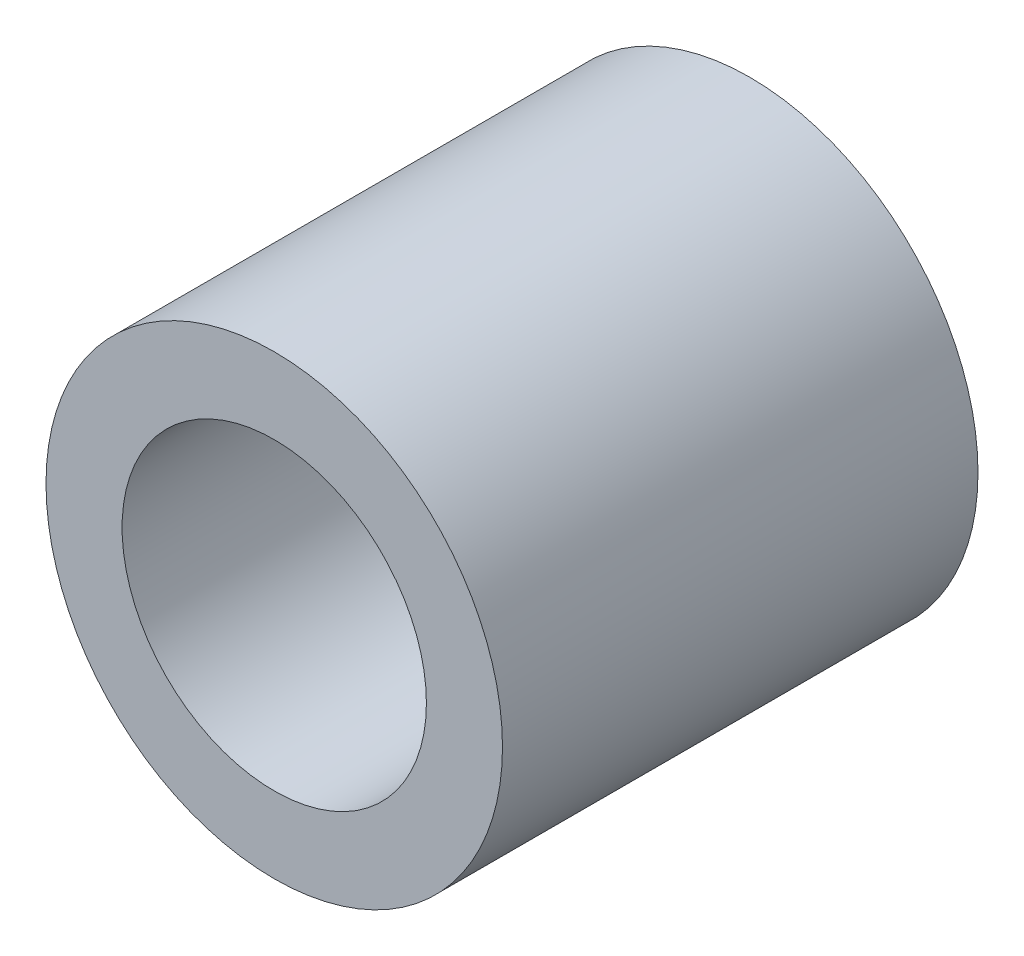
ISO-10303-21;
HEADER;
FILE_DESCRIPTION(('STEP AP214'),'2;1');
FILE_NAME('part.step','',(''),(''),'','','');
FILE_SCHEMA(('AUTOMOTIVE_DESIGN { 1 0 10303 214 1 1 1 1 }'));
ENDSEC;
DATA;
#1=APPLICATION_CONTEXT('core data for automotive mechanical design processes');
#2=APPLICATION_PROTOCOL_DEFINITION('international standard','automotive_design',2000,#1);
#3=PRODUCT_CONTEXT('',#1,'mechanical');
#4=PRODUCT('Part','Part','',(#3));
#5=PRODUCT_RELATED_PRODUCT_CATEGORY('part','',(#4));
#6=PRODUCT_DEFINITION_FORMATION('','',#4);
#7=PRODUCT_DEFINITION_CONTEXT('part definition',#1,'design');
#8=PRODUCT_DEFINITION('design','',#6,#7);
#9=PRODUCT_DEFINITION_SHAPE('','',#8);
#10=(LENGTH_UNIT() NAMED_UNIT(*) SI_UNIT(.MILLI.,.METRE.));
#11=(NAMED_UNIT(*) PLANE_ANGLE_UNIT() SI_UNIT($,.RADIAN.));
#12=(NAMED_UNIT(*) SI_UNIT($,.STERADIAN.) SOLID_ANGLE_UNIT());
#13=UNCERTAINTY_MEASURE_WITH_UNIT(LENGTH_MEASURE(1.E-05),#10,'distance_accuracy_value','');
#14=(GEOMETRIC_REPRESENTATION_CONTEXT(3) GLOBAL_UNCERTAINTY_ASSIGNED_CONTEXT((#13)) GLOBAL_UNIT_ASSIGNED_CONTEXT((#10,
#11,#12)) REPRESENTATION_CONTEXT('',''));
#15=CARTESIAN_POINT('',(0.,0.,0.));
#16=DIRECTION('',(0.,0.,1.));
#17=DIRECTION('',(1.,0.,0.));
#18=AXIS2_PLACEMENT_3D('',#15,#16,#17);
#19=CARTESIAN_POINT('',(0.,98.,-58.9411254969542));
#20=DIRECTION('',(0.,0.,1.));
#21=DIRECTION('',(1.,0.,0.));
#22=AXIS2_PLACEMENT_3D('',#19,#20,#21);
#23=CYLINDRICAL_SURFACE('',#22,12.);
#24=CARTESIAN_POINT('',(0.,98.,0.));
#25=DIRECTION('',(0.,0.,1.));
#26=DIRECTION('',(1.,0.,0.));
#27=AXIS2_PLACEMENT_3D('',#24,#25,#26);
#28=CIRCLE('',#27,12.);
#29=CARTESIAN_POINT('',(12.,98.,0.));
#30=VERTEX_POINT('',#29);
#31=EDGE_CURVE('E37',#30,#30,#28,.T.);
#32=ORIENTED_EDGE('',*,*,#31,.F.);
#33=EDGE_LOOP('',(#32));
#34=FACE_BOUND('',#33,.T.);
#35=CARTESIAN_POINT('',(0.,98.,-25.));
#36=DIRECTION('',(0.,0.,-1.));
#37=DIRECTION('',(-1.,0.,0.));
#38=AXIS2_PLACEMENT_3D('',#35,#36,#37);
#39=CIRCLE('',#38,12.);
#40=CARTESIAN_POINT('',(-12.,98.,-25.));
#41=VERTEX_POINT('',#40);
#42=EDGE_CURVE('E46',#41,#41,#39,.F.);
#43=ORIENTED_EDGE('',*,*,#42,.T.);
#44=EDGE_LOOP('',(#43));
#45=FACE_BOUND('',#44,.T.);
#46=ADVANCED_FACE('F30',(#34,#45),#23,.T.);
#47=CARTESIAN_POINT('',(0.,98.,-58.9411254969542));
#48=DIRECTION('',(0.,0.,1.));
#49=DIRECTION('',(1.,0.,0.));
#50=AXIS2_PLACEMENT_3D('',#47,#48,#49);
#51=CYLINDRICAL_SURFACE('',#50,8.);
#52=CARTESIAN_POINT('',(0.,98.,0.));
#53=DIRECTION('',(0.,0.,1.));
#54=DIRECTION('',(1.,0.,0.));
#55=AXIS2_PLACEMENT_3D('',#52,#53,#54);
#56=CIRCLE('',#55,8.);
#57=CARTESIAN_POINT('',(8.00000000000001,98.,0.));
#58=VERTEX_POINT('',#57);
#59=EDGE_CURVE('E41',#58,#58,#56,.T.);
#60=ORIENTED_EDGE('',*,*,#59,.T.);
#61=EDGE_LOOP('',(#60));
#62=FACE_BOUND('',#61,.T.);
#63=CARTESIAN_POINT('',(0.,98.,-25.));
#64=DIRECTION('',(0.,0.,-1.));
#65=DIRECTION('',(-1.,0.,0.));
#66=AXIS2_PLACEMENT_3D('',#63,#64,#65);
#67=CIRCLE('',#66,8.);
#68=CARTESIAN_POINT('',(-8.00000000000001,98.,-25.));
#69=VERTEX_POINT('',#68);
#70=EDGE_CURVE('E10',#69,#69,#67,.F.);
#71=ORIENTED_EDGE('',*,*,#70,.F.);
#72=EDGE_LOOP('',(#71));
#73=FACE_BOUND('',#72,.T.);
#74=ADVANCED_FACE('F57',(#62,#73),#51,.F.);
#75=CARTESIAN_POINT('',(0.,98.,0.));
#76=DIRECTION('',(0.,0.,1.));
#77=DIRECTION('',(1.,0.,0.));
#78=AXIS2_PLACEMENT_3D('',#75,#76,#77);
#79=PLANE('',#78);
#80=ORIENTED_EDGE('',*,*,#59,.F.);
#81=EDGE_LOOP('',(#80));
#82=FACE_BOUND('',#81,.T.);
#83=ORIENTED_EDGE('',*,*,#31,.T.);
#84=EDGE_LOOP('',(#83));
#85=FACE_BOUND('',#84,.T.);
#86=ADVANCED_FACE('F53',(#82,#85),#79,.T.);
#87=CARTESIAN_POINT('',(0.,98.,-25.));
#88=DIRECTION('',(0.,0.,-1.));
#89=DIRECTION('',(-1.,0.,0.));
#90=AXIS2_PLACEMENT_3D('',#87,#88,#89);
#91=PLANE('',#90);
#92=ORIENTED_EDGE('',*,*,#42,.F.);
#93=EDGE_LOOP('',(#92));
#94=FACE_BOUND('',#93,.T.);
#95=ORIENTED_EDGE('',*,*,#70,.T.);
#96=EDGE_LOOP('',(#95));
#97=FACE_BOUND('',#96,.T.);
#98=ADVANCED_FACE('F32',(#94,#97),#91,.T.);
#99=CLOSED_SHELL('',(#46,#74,#86,#98));
#100=MANIFOLD_SOLID_BREP('B2',#99);
#101=ADVANCED_BREP_SHAPE_REPRESENTATION('',(#18,#100),#14);
#102=SHAPE_DEFINITION_REPRESENTATION(#9,#101);
ENDSEC;
END-ISO-10303-21;
